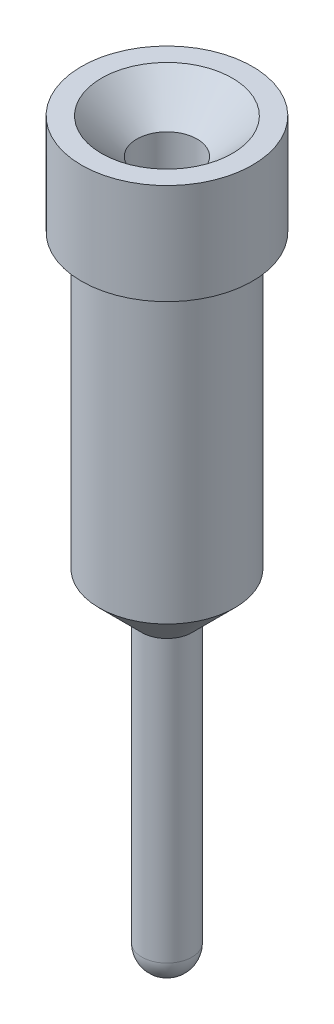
from build123d import *


with BuildPart() as part:
    # Sketch1 → Revolve1 (revolve)
    with BuildSketch(Plane.XY, mode=Mode.PRIVATE) as revolve1_sk:
        with BuildLine():
            Line((-0.85, 0), (-0.85, -1))
            Line((-0.85, -1), (-0.675, -1))
            Line((-0.675, -1), (-0.675, -3.9))
            Line((-0.675, -3.9), (-0.25, -4.325))
            Line((-0.25, -4.325), (-0.25, -7.12))
            ThreePointArc((-0.25, -7.12), (-0.176776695, -7.296776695), (0, -7.37))
            Line((0, -7.37), (0, -4))
            Line((0, -4), (-0.3, -3.7))
            Line((-0.3, -3.7), (-0.3, -0.35))
            Line((-0.3, -0.35), (-0.65, 0))
            Line((-0.65, 0), (-0.85, 0))
        make_face()
    revolve(revolve1_sk.sketch.rotate(Axis((0, 28.992562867, 0), (0, -1, 0)), 270), axis=Axis((0, 28.992562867, 0), (0, -1, 0)))


solid = part.part
